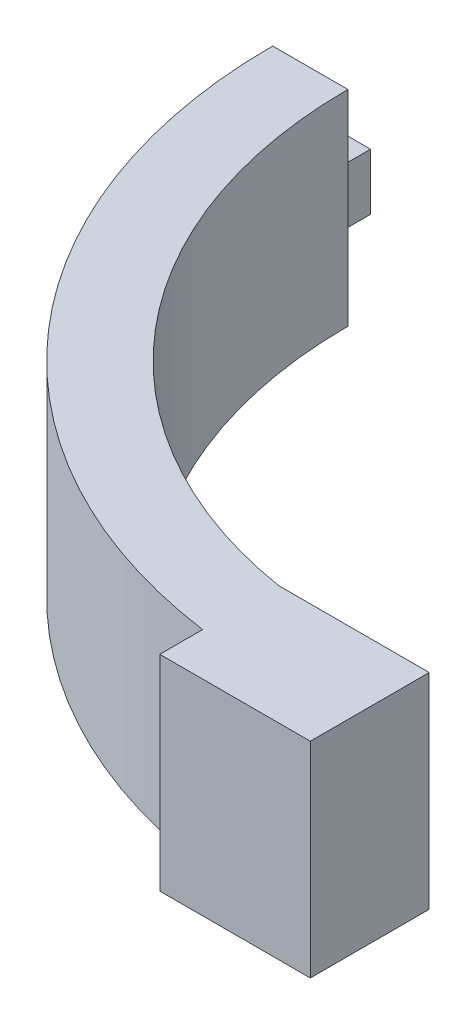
from build123d import *

# Parameters (mm, degrees)
BOSS_EXTRUDE2_DEPTH     = 54.5
CUT_EXTRUDE1_DEPTH      = 320.992578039
CUT_EXTRUDE1_DEPTH_BACK = 320.992578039
SKETCH3_W               = 203.108733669
SKETCH3_H               = 171.373523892
SKETCH4_W               = 14
SKETCH4_H               = 7.5
BOSS_EXTRUDE3_DEPTH     = 9


with BuildPart() as part:
    # Sketch2 → Boss-Extrude2 (new body)
    with BuildSketch(Plane(origin=(0, 0, 0), x_dir=(1, 0, 0), z_dir=(0, 1, 0))):
        with BuildLine():
            Line((20, 280), (-20, 280))
            Line((-20, 280), (-20, 268.614066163))
            ThreePointArc((-20, 268.614066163), (-145, 125), (-20, -18.614066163))
            Line((-20, -18.614066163), (-20, -30))
            Line((-20, -30), (20, -30))
            Line((20, -30), (20, 0))
            Line((20, 0), (20, 1.610373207))
            Line((20, 1.610373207), (-20, 1.610373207))
            ThreePointArc((-20, 1.610373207), (-125, 125), (-20, 248.389626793))
            Line((-20, 248.389626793), (20, 248.389626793))
            Line((20, 248.389626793), (20, 280))
        make_face()
    extrude(amount=BOSS_EXTRUDE2_DEPTH)

    # Sketch3 → Cut-Extrude1 (cut, two sides: drawn at the far end of the back side and taken through both)
    with BuildSketch(Plane(origin=(0, 54.5, 0), x_dir=(1, 0, 0), z_dir=(0, 1, 0)).offset(-CUT_EXTRUDE1_DEPTH_BACK)):
        with Locations((-43.445633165, 210.686761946)):
            Rectangle(SKETCH3_W, SKETCH3_H)
    extrude(amount=CUT_EXTRUDE1_DEPTH + CUT_EXTRUDE1_DEPTH_BACK, mode=Mode.SUBTRACT)

    # Sketch4 → Boss-Extrude3 (add)
    with BuildSketch(Plane(origin=(0, 0, -125), x_dir=(-1, 0, 0), z_dir=(0, 0, -1))):
        with Locations((135, 23.5000015)):
            Rectangle(SKETCH4_W, SKETCH4_H)
        with Locations((135, 31.0000015)):
            Rectangle(SKETCH4_W, SKETCH4_H)
    extrude(amount=BOSS_EXTRUDE3_DEPTH)


solid = part.part
